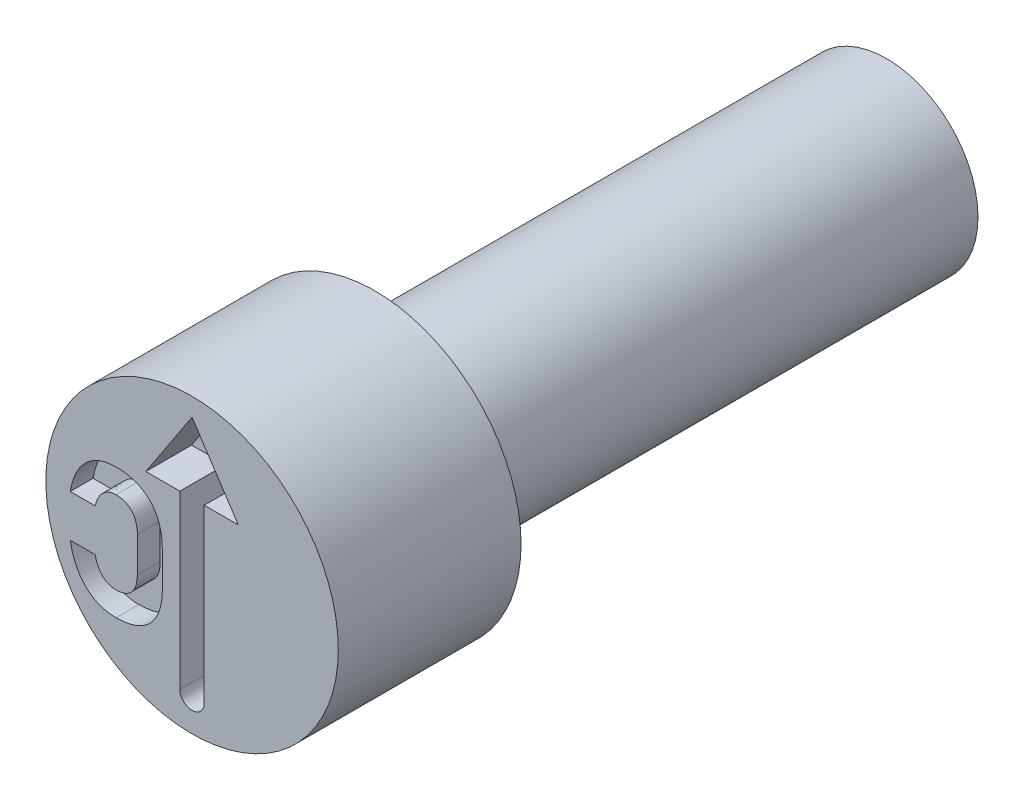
ISO-10303-21;
HEADER;
FILE_DESCRIPTION(('STEP AP214'),'2;1');
FILE_NAME('part.step','',(''),(''),'','','');
FILE_SCHEMA(('AUTOMOTIVE_DESIGN { 1 0 10303 214 1 1 1 1 }'));
ENDSEC;
DATA;
#1=APPLICATION_CONTEXT('core data for automotive mechanical design processes');
#2=APPLICATION_PROTOCOL_DEFINITION('international standard','automotive_design',2000,#1);
#3=PRODUCT_CONTEXT('',#1,'mechanical');
#4=PRODUCT('Part','Part','',(#3));
#5=PRODUCT_RELATED_PRODUCT_CATEGORY('part','',(#4));
#6=PRODUCT_DEFINITION_FORMATION('','',#4);
#7=PRODUCT_DEFINITION_CONTEXT('part definition',#1,'design');
#8=PRODUCT_DEFINITION('design','',#6,#7);
#9=PRODUCT_DEFINITION_SHAPE('','',#8);
#10=(LENGTH_UNIT() NAMED_UNIT(*) SI_UNIT(.MILLI.,.METRE.));
#11=(NAMED_UNIT(*) PLANE_ANGLE_UNIT() SI_UNIT($,.RADIAN.));
#12=(NAMED_UNIT(*) SI_UNIT($,.STERADIAN.) SOLID_ANGLE_UNIT());
#13=UNCERTAINTY_MEASURE_WITH_UNIT(LENGTH_MEASURE(1.E-05),#10,'distance_accuracy_value','');
#14=(GEOMETRIC_REPRESENTATION_CONTEXT(3) GLOBAL_UNCERTAINTY_ASSIGNED_CONTEXT((#13)) GLOBAL_UNIT_ASSIGNED_CONTEXT((#10,
#11,#12)) REPRESENTATION_CONTEXT('',''));
#15=CARTESIAN_POINT('',(0.,0.,0.));
#16=DIRECTION('',(0.,0.,1.));
#17=DIRECTION('',(1.,0.,0.));
#18=AXIS2_PLACEMENT_3D('',#15,#16,#17);
#19=CARTESIAN_POINT('',(0.,0.5,-1.));
#20=DIRECTION('',(0.,0.,1.));
#21=DIRECTION('',(1.,0.,0.));
#22=AXIS2_PLACEMENT_3D('',#19,#20,#21);
#23=PLANE('',#22);
#24=CARTESIAN_POINT('',(0.,0.,-1.));
#25=DIRECTION('',(0.,0.,1.));
#26=DIRECTION('',(1.,0.,0.));
#27=AXIS2_PLACEMENT_3D('',#24,#25,#26);
#28=CIRCLE('',#27,0.8);
#29=CARTESIAN_POINT('',(0.8,0.,-1.));
#30=VERTEX_POINT('',#29);
#31=EDGE_CURVE('E11',#30,#30,#28,.T.);
#32=ORIENTED_EDGE('',*,*,#31,.F.);
#33=EDGE_LOOP('',(#32));
#34=FACE_BOUND('',#33,.T.);
#35=CARTESIAN_POINT('',(0.,0.,-1.));
#36=DIRECTION('',(0.,0.,1.));
#37=DIRECTION('',(1.,0.,0.));
#38=AXIS2_PLACEMENT_3D('',#35,#36,#37);
#39=CIRCLE('',#38,0.5);
#40=CARTESIAN_POINT('',(0.5,0.,-1.));
#41=VERTEX_POINT('',#40);
#42=EDGE_CURVE('E262',#41,#41,#39,.T.);
#43=ORIENTED_EDGE('',*,*,#42,.T.);
#44=EDGE_LOOP('',(#43));
#45=FACE_BOUND('',#44,.T.);
#46=ADVANCED_FACE('F34',(#34,#45),#23,.F.);
#47=CARTESIAN_POINT('',(0.,0.,-0.403888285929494));
#48=DIRECTION('',(0.,0.,1.));
#49=DIRECTION('',(1.,0.,0.));
#50=AXIS2_PLACEMENT_3D('',#47,#48,#49);
#51=CYLINDRICAL_SURFACE('',#50,0.8);
#52=CARTESIAN_POINT('',(0.,0.,0.));
#53=DIRECTION('',(0.,0.,1.));
#54=DIRECTION('',(1.,0.,0.));
#55=AXIS2_PLACEMENT_3D('',#52,#53,#54);
#56=CIRCLE('',#55,0.8);
#57=CARTESIAN_POINT('',(0.8,0.,0.));
#58=VERTEX_POINT('',#57);
#59=EDGE_CURVE('E41',#58,#58,#56,.T.);
#60=ORIENTED_EDGE('',*,*,#59,.F.);
#61=EDGE_LOOP('',(#60));
#62=FACE_BOUND('',#61,.T.);
#63=ORIENTED_EDGE('',*,*,#31,.T.);
#64=EDGE_LOOP('',(#63));
#65=FACE_BOUND('',#64,.T.);
#66=ADVANCED_FACE('F247',(#62,#65),#51,.T.);
#67=CARTESIAN_POINT('',(0.,0.8,0.));
#68=DIRECTION('',(0.,0.,-1.));
#69=DIRECTION('',(-1.,0.,0.));
#70=AXIS2_PLACEMENT_3D('',#67,#68,#69);
#71=PLANE('',#70);
#72=CARTESIAN_POINT('',(-0.41583452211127,-0.457275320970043,0.));
#73=CARTESIAN_POINT('',(-0.409317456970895,-0.45720482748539,0.));
#74=CARTESIAN_POINT('',(-0.396457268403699,-0.457065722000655,0.));
#75=CARTESIAN_POINT('',(-0.377547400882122,-0.455618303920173,0.));
#76=CARTESIAN_POINT('',(-0.3593040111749,-0.453198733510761,0.));
#77=CARTESIAN_POINT('',(-0.34182658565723,-0.449786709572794,0.));
#78=CARTESIAN_POINT('',(-0.3250668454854,-0.445482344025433,0.));
#79=CARTESIAN_POINT('',(-0.308953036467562,-0.440394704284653,0.));
#80=CARTESIAN_POINT('',(-0.293640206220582,-0.434096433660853,0.));
#81=CARTESIAN_POINT('',(-0.278979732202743,-0.426954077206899,0.));
#82=CARTESIAN_POINT('',(-0.265178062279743,-0.418870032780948,0.));
#83=CARTESIAN_POINT('',(-0.252264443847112,-0.409777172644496,0.));
#84=CARTESIAN_POINT('',(-0.240110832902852,-0.399960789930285,0.));
#85=CARTESIAN_POINT('',(-0.228809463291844,-0.389224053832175,0.));
#86=CARTESIAN_POINT('',(-0.218372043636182,-0.377629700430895,0.));
#87=CARTESIAN_POINT('',(-0.208739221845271,-0.365164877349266,0.));
#88=CARTESIAN_POINT('',(-0.200108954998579,-0.351750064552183,0.));
#89=CARTESIAN_POINT('',(-0.192213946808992,-0.337566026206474,0.));
#90=CARTESIAN_POINT('',(-0.185189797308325,-0.322573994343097,0.));
#91=CARTESIAN_POINT('',(-0.179261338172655,-0.306702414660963,0.));
#92=CARTESIAN_POINT('',(-0.174121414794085,-0.290126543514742,0.));
#93=CARTESIAN_POINT('',(-0.169821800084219,-0.272849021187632,0.));
#94=CARTESIAN_POINT('',(-0.166529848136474,-0.254791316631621,0.));
#95=CARTESIAN_POINT('',(-0.164335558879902,-0.235967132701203,0.));
#96=CARTESIAN_POINT('',(-0.162814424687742,-0.216358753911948,0.));
#97=CARTESIAN_POINT('',(-0.162688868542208,-0.203022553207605,0.));
#98=CARTESIAN_POINT('',(-0.162624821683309,-0.196219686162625,0.));
#99=B_SPLINE_CURVE_WITH_KNOTS('',3,(#72,#73,#74,#75,#76,#77,#78,#79,#80,#81,#82,#83,#84,#85,#86,
#87,#88,#89,#90,#91,#92,#93,#94,#95,#96,#97,#98),.UNSPECIFIED.,.F.,.F.,(4,1,1,1,1,1,1,1,1,1,1,1,
1,1,1,1,1,1,1,1,1,1,1,1,4),(0.,0.0472598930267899,0.093258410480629,0.137448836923,
0.180669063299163,0.222325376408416,0.262898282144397,0.303117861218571,0.342294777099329,
0.381096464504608,0.418984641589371,0.456742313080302,0.494310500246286,0.531916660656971,
0.569787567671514,0.608434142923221,0.647492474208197,0.687453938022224,0.728384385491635,
0.770272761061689,0.813266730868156,0.85743965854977,0.903297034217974,0.950671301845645,1.),.UNSPECIFIED.);
#100=CARTESIAN_POINT('',(-0.41583452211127,-0.457275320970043,0.));
#101=VERTEX_POINT('',#100);
#102=CARTESIAN_POINT('',(-0.162624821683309,-0.196219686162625,0.));
#103=VERTEX_POINT('',#102);
#104=EDGE_CURVE('E400',#101,#103,#99,.T.);
#105=ORIENTED_EDGE('',*,*,#104,.F.);
#106=CARTESIAN_POINT('',(-0.666619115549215,-0.215477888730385,0.));
#107=CARTESIAN_POINT('',(-0.664181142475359,-0.227847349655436,0.));
#108=CARTESIAN_POINT('',(-0.659441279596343,-0.251895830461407,0.));
#109=CARTESIAN_POINT('',(-0.648789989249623,-0.28614256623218,0.));
#110=CARTESIAN_POINT('',(-0.63566411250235,-0.317607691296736,0.));
#111=CARTESIAN_POINT('',(-0.620043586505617,-0.346244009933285,0.));
#112=CARTESIAN_POINT('',(-0.601833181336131,-0.3717683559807,0.));
#113=CARTESIAN_POINT('',(-0.581468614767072,-0.394276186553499,0.));
#114=CARTESIAN_POINT('',(-0.558777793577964,-0.413577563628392,0.));
#115=CARTESIAN_POINT('',(-0.533807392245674,-0.42947853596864,0.));
#116=CARTESIAN_POINT('',(-0.506845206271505,-0.441979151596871,0.));
#117=CARTESIAN_POINT('',(-0.478038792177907,-0.450758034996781,0.));
#118=CARTESIAN_POINT('',(-0.447536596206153,-0.456437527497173,0.));
#119=CARTESIAN_POINT('',(-0.426559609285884,-0.456991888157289,0.));
#120=CARTESIAN_POINT('',(-0.41583452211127,-0.457275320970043,0.));
#121=B_SPLINE_CURVE_WITH_KNOTS('',3,(#106,#107,#108,#109,#110,#111,#112,#113,#114,#115,#116,
#117,#118,#119,#120),.UNSPECIFIED.,.F.,.F.,(4,1,1,1,1,1,1,1,1,1,1,1,4),(0.,0.0988237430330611,
0.192131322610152,0.28071953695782,0.365844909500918,0.447392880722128,0.52606487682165,
0.603327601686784,0.680299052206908,0.757555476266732,0.835645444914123,0.915969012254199,1.),.UNSPECIFIED.);
#122=CARTESIAN_POINT('',(-0.666619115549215,-0.215477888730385,0.));
#123=VERTEX_POINT('',#122);
#124=EDGE_CURVE('E48',#123,#101,#121,.T.);
#125=ORIENTED_EDGE('',*,*,#124,.F.);
#126=DIRECTION('',(-1.,0.,0.));
#127=VECTOR('',#126,1.);
#128=CARTESIAN_POINT('',(-0.529957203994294,-0.215477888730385,0.));
#129=LINE('',#128,#127);
#130=CARTESIAN_POINT('',(-0.529957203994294,-0.215477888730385,0.));
#131=VERTEX_POINT('',#130);
#132=EDGE_CURVE('E185',#131,#123,#129,.T.);
#133=ORIENTED_EDGE('',*,*,#132,.F.);
#134=CARTESIAN_POINT('',(-0.41583452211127,-0.325320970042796,0.));
#135=CARTESIAN_POINT('',(-0.420549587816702,-0.325135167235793,0.));
#136=CARTESIAN_POINT('',(-0.429797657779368,-0.324770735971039,0.));
#137=CARTESIAN_POINT('',(-0.443308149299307,-0.32253976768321,0.));
#138=CARTESIAN_POINT('',(-0.456028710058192,-0.318428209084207,0.));
#139=CARTESIAN_POINT('',(-0.468045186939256,-0.312888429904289,0.));
#140=CARTESIAN_POINT('',(-0.479269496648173,-0.305731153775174,0.));
#141=CARTESIAN_POINT('',(-0.489381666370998,-0.296887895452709,0.));
#142=CARTESIAN_POINT('',(-0.498800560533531,-0.286821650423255,0.));
#143=CARTESIAN_POINT('',(-0.507183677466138,-0.275204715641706,0.));
#144=CARTESIAN_POINT('',(-0.51461498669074,-0.262204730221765,0.));
#145=CARTESIAN_POINT('',(-0.520829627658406,-0.247816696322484,0.));
#146=CARTESIAN_POINT('',(-0.526224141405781,-0.23220085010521,0.));
#147=CARTESIAN_POINT('',(-0.528687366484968,-0.221166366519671,0.));
#148=CARTESIAN_POINT('',(-0.529957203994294,-0.215477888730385,0.));
#149=B_SPLINE_CURVE_WITH_KNOTS('',3,(#134,#135,#136,#137,#138,#139,#140,#141,#142,#143,#144,
#145,#146,#147,#148),.UNSPECIFIED.,.F.,.F.,(4,1,1,1,1,1,1,1,1,1,1,1,4),(0.,0.081756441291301,
0.160356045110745,0.236478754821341,0.312819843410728,0.389192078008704,0.466352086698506,
0.545094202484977,0.627698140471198,0.714093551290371,0.80415108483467,0.89903630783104,1.),.UNSPECIFIED.);
#150=CARTESIAN_POINT('',(-0.41583452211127,-0.325320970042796,0.));
#151=VERTEX_POINT('',#150);
#152=EDGE_CURVE('E188',#151,#131,#149,.T.);
#153=ORIENTED_EDGE('',*,*,#152,.F.);
#154=CARTESIAN_POINT('',(-0.299286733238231,-0.196219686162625,0.));
#155=CARTESIAN_POINT('',(-0.29944050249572,-0.20279036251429,0.));
#156=CARTESIAN_POINT('',(-0.299738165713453,-0.21550973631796,0.));
#157=CARTESIAN_POINT('',(-0.30231695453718,-0.233833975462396,0.));
#158=CARTESIAN_POINT('',(-0.306583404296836,-0.250689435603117,0.));
#159=CARTESIAN_POINT('',(-0.312502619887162,-0.266047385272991,0.));
#160=CARTESIAN_POINT('',(-0.320277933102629,-0.279688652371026,0.));
#161=CARTESIAN_POINT('',(-0.32951168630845,-0.291723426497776,0.));
#162=CARTESIAN_POINT('',(-0.340257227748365,-0.302122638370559,0.));
#163=CARTESIAN_POINT('',(-0.352681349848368,-0.310583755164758,0.));
#164=CARTESIAN_POINT('',(-0.36654107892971,-0.317202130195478,0.));
#165=CARTESIAN_POINT('',(-0.381783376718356,-0.321854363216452,0.));
#166=CARTESIAN_POINT('',(-0.398367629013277,-0.32477467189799,0.));
#167=CARTESIAN_POINT('',(-0.409877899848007,-0.325134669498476,0.));
#168=CARTESIAN_POINT('',(-0.41583452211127,-0.325320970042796,0.));
#169=B_SPLINE_CURVE_WITH_KNOTS('',3,(#154,#155,#156,#157,#158,#159,#160,#161,#162,#163,#164,
#165,#166,#167,#168),.UNSPECIFIED.,.F.,.F.,(4,1,1,1,1,1,1,1,1,1,1,1,4),(0.,0.0997433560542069,
0.193081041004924,0.280299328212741,0.363302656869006,0.442209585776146,0.517891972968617,
0.592965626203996,0.668275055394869,0.745143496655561,0.825309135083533,0.909596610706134,1.),.UNSPECIFIED.);
#170=CARTESIAN_POINT('',(-0.299286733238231,-0.196219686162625,0.));
#171=VERTEX_POINT('',#170);
#172=EDGE_CURVE('E348',#171,#151,#169,.T.);
#173=ORIENTED_EDGE('',*,*,#172,.F.);
#174=DIRECTION('',(0.,-1.,0.));
#175=VECTOR('',#174,1.);
#176=CARTESIAN_POINT('',(-0.299286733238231,-0.00420827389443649,0.));
#177=LINE('',#176,#175);
#178=CARTESIAN_POINT('',(-0.299286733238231,-0.00420827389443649,0.));
#179=VERTEX_POINT('',#178);
#180=EDGE_CURVE('E356',#179,#171,#177,.T.);
#181=ORIENTED_EDGE('',*,*,#180,.F.);
#182=CARTESIAN_POINT('',(-0.41583452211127,0.125320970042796,0.));
#183=CARTESIAN_POINT('',(-0.409882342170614,0.125112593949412,0.));
#184=CARTESIAN_POINT('',(-0.398388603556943,0.124710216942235,0.));
#185=CARTESIAN_POINT('',(-0.381737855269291,0.122088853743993,0.));
#186=CARTESIAN_POINT('',(-0.366570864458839,0.117150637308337,0.));
#187=CARTESIAN_POINT('',(-0.352675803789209,0.11059959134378,0.));
#188=CARTESIAN_POINT('',(-0.340263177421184,0.102114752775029,0.));
#189=CARTESIAN_POINT('',(-0.329466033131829,0.0917130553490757,0.));
#190=CARTESIAN_POINT('',(-0.320278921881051,0.0795356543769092,0.));
#191=CARTESIAN_POINT('',(-0.31253747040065,0.0657921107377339,0.));
#192=CARTESIAN_POINT('',(-0.306551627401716,0.0503658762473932,0.));
#193=CARTESIAN_POINT('',(-0.30233990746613,0.033447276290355,0.));
#194=CARTESIAN_POINT('',(-0.299733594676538,0.0150830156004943,0.));
#195=CARTESIAN_POINT('',(-0.299438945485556,0.0023628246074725,0.));
#196=CARTESIAN_POINT('',(-0.299286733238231,-0.00420827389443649,0.));
#197=B_SPLINE_CURVE_WITH_KNOTS('',3,(#182,#183,#184,#185,#186,#187,#188,#189,#190,#191,#192,
#193,#194,#195,#196),.UNSPECIFIED.,.F.,.F.,(4,1,1,1,1,1,1,1,1,1,1,1,4),(0.,0.0902231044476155,
0.174222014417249,0.25444494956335,0.331160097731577,0.406319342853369,0.481243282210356,
0.557346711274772,0.636723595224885,0.719561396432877,0.807304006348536,0.900455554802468,1.),.UNSPECIFIED.);
#198=CARTESIAN_POINT('',(-0.41583452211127,0.125320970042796,0.));
#199=VERTEX_POINT('',#198);
#200=EDGE_CURVE('E362',#199,#179,#197,.T.);
#201=ORIENTED_EDGE('',*,*,#200,.F.);
#202=CARTESIAN_POINT('',(-0.529957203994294,0.0156205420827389,0.));
#203=CARTESIAN_POINT('',(-0.52857871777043,0.0212121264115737,0.));
#204=CARTESIAN_POINT('',(-0.525896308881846,0.032092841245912,0.));
#205=CARTESIAN_POINT('',(-0.520373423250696,0.0475715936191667,0.));
#206=CARTESIAN_POINT('',(-0.51409335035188,0.0619090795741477,0.));
#207=CARTESIAN_POINT('',(-0.506412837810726,0.0747637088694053,0.));
#208=CARTESIAN_POINT('',(-0.498051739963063,0.0864458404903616,0.));
#209=CARTESIAN_POINT('',(-0.48862235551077,0.0965668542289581,0.));
#210=CARTESIAN_POINT('',(-0.478331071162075,0.105294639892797,0.));
#211=CARTESIAN_POINT('',(-0.467257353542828,0.112513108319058,0.));
#212=CARTESIAN_POINT('',(-0.455431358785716,0.118396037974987,0.));
#213=CARTESIAN_POINT('',(-0.442799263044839,0.122289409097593,0.));
#214=CARTESIAN_POINT('',(-0.429535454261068,0.124831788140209,0.));
#215=CARTESIAN_POINT('',(-0.420459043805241,0.125155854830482,0.));
#216=CARTESIAN_POINT('',(-0.41583452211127,0.125320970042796,0.));
#217=B_SPLINE_CURVE_WITH_KNOTS('',3,(#202,#203,#204,#205,#206,#207,#208,#209,#210,#211,#212,
#213,#214,#215,#216),.UNSPECIFIED.,.F.,.F.,(4,1,1,1,1,1,1,1,1,1,1,1,4),(0.,0.100258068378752,
0.195093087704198,0.285925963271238,0.37244127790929,0.455447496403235,0.535743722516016,
0.612742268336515,0.689936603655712,0.765509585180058,0.842003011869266,0.919498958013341,1.),.UNSPECIFIED.);
#218=CARTESIAN_POINT('',(-0.529957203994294,0.0156205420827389,0.));
#219=VERTEX_POINT('',#218);
#220=EDGE_CURVE('E367',#219,#199,#217,.T.);
#221=ORIENTED_EDGE('',*,*,#220,.F.);
#222=DIRECTION('',(1.,0.,0.));
#223=VECTOR('',#222,1.);
#224=CARTESIAN_POINT('',(-0.666619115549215,0.0156205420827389,0.));
#225=LINE('',#224,#223);
#226=CARTESIAN_POINT('',(-0.666619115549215,0.0156205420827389,0.));
#227=VERTEX_POINT('',#226);
#228=EDGE_CURVE('E375',#227,#219,#225,.T.);
#229=ORIENTED_EDGE('',*,*,#228,.F.);
#230=CARTESIAN_POINT('',(-0.41583452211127,0.257275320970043,0.));
#231=CARTESIAN_POINT('',(-0.426559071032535,0.256988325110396,0.));
#232=CARTESIAN_POINT('',(-0.447581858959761,0.256425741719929,0.));
#233=CARTESIAN_POINT('',(-0.478136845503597,0.250777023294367,0.));
#234=CARTESIAN_POINT('',(-0.506990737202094,0.241982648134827,0.));
#235=CARTESIAN_POINT('',(-0.533974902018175,0.22944262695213,0.));
#236=CARTESIAN_POINT('',(-0.559004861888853,0.213620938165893,0.));
#237=CARTESIAN_POINT('',(-0.581787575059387,0.194370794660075,0.));
#238=CARTESIAN_POINT('',(-0.602315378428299,0.171944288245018,0.));
#239=CARTESIAN_POINT('',(-0.620411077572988,0.146249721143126,0.));
#240=CARTESIAN_POINT('',(-0.636126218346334,0.117645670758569,0.));
#241=CARTESIAN_POINT('',(-0.64906352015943,0.0861286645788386,0.));
#242=CARTESIAN_POINT('',(-0.659564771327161,0.0519336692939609,0.));
#243=CARTESIAN_POINT('',(-0.664225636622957,0.0279412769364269,0.));
#244=CARTESIAN_POINT('',(-0.666619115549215,0.0156205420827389,0.));
#245=B_SPLINE_CURVE_WITH_KNOTS('',3,(#230,#231,#232,#233,#234,#235,#236,#237,#238,#239,#240,
#241,#242,#243,#244),.UNSPECIFIED.,.F.,.F.,(4,1,1,1,1,1,1,1,1,1,1,1,4),(0.,0.0840057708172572,
0.164672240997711,0.242738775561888,0.319972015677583,0.397234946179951,0.474233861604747,
0.553133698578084,0.634960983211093,0.720060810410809,0.808478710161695,0.901648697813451,1.),.UNSPECIFIED.);
#246=CARTESIAN_POINT('',(-0.41583452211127,0.257275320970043,0.));
#247=VERTEX_POINT('',#246);
#248=EDGE_CURVE('E381',#247,#227,#245,.T.);
#249=ORIENTED_EDGE('',*,*,#248,.F.);
#250=CARTESIAN_POINT('',(-0.162624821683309,-0.00420827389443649,0.));
#251=CARTESIAN_POINT('',(-0.162688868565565,0.00259459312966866,0.));
#252=CARTESIAN_POINT('',(-0.162814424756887,0.0159307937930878,0.));
#253=CARTESIAN_POINT('',(-0.164335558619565,0.035539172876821,0.));
#254=CARTESIAN_POINT('',(-0.166529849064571,0.0543633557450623,0.));
#255=CARTESIAN_POINT('',(-0.16982179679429,0.0724210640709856,0.));
#256=CARTESIAN_POINT('',(-0.17412142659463,0.0896985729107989,0.));
#257=CARTESIAN_POINT('',(-0.179261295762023,0.106274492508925,0.));
#258=CARTESIAN_POINT('',(-0.185189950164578,0.122145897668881,0.));
#259=CARTESIAN_POINT('',(-0.192213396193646,0.137138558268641,0.));
#260=CARTESIAN_POINT('',(-0.200110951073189,0.151320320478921,0.));
#261=CARTESIAN_POINT('',(-0.208731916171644,0.164743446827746,0.));
#262=CARTESIAN_POINT('',(-0.218420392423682,0.177205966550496,0.));
#263=CARTESIAN_POINT('',(-0.22875868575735,0.188936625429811,0.));
#264=CARTESIAN_POINT('',(-0.240117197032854,0.199670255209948,0.));
#265=CARTESIAN_POINT('',(-0.252264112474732,0.209490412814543,0.));
#266=CARTESIAN_POINT('',(-0.265172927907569,0.218595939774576,0.));
#267=CARTESIAN_POINT('',(-0.27901954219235,0.226634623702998,0.));
#268=CARTESIAN_POINT('',(-0.29359558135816,0.234000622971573,0.));
#269=CARTESIAN_POINT('',(-0.308987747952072,0.240199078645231,0.));
#270=CARTESIAN_POINT('',(-0.325035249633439,0.245530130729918,0.));
#271=CARTESIAN_POINT('',(-0.341831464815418,0.249772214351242,0.));
#272=CARTESIAN_POINT('',(-0.359302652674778,0.253202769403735,0.));
#273=CARTESIAN_POINT('',(-0.377547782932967,0.255617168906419,0.));
#274=CARTESIAN_POINT('',(-0.396457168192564,0.257066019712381,0.));
#275=CARTESIAN_POINT('',(-0.409317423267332,0.257204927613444,0.));
#276=CARTESIAN_POINT('',(-0.41583452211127,0.257275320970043,0.));
#277=B_SPLINE_CURVE_WITH_KNOTS('',3,(#250,#251,#252,#253,#254,#255,#256,#257,#258,#259,#260,
#261,#262,#263,#264,#265,#266,#267,#268,#269,#270,#271,#272,#273,#274,#275,#276),.UNSPECIFIED.,
.F.,.F.,(4,1,1,1,1,1,1,1,1,1,1,1,1,1,1,1,1,1,1,1,1,1,1,1,4),(0.,0.0493032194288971,
0.0966530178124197,0.142486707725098,0.186636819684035,0.229608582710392,0.271475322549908,
0.31238462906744,0.352325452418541,0.391363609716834,0.429990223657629,0.467841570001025,
0.505685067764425,0.543233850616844,0.580972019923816,0.618840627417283,0.657622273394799,
0.696931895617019,0.737130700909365,0.777789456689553,0.819424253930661,0.862622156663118,
0.906789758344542,0.952764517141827,1.),.UNSPECIFIED.);
#278=CARTESIAN_POINT('',(-0.162624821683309,-0.00420827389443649,0.));
#279=VERTEX_POINT('',#278);
#280=EDGE_CURVE('E386',#279,#247,#277,.T.);
#281=ORIENTED_EDGE('',*,*,#280,.F.);
#282=DIRECTION('',(0.,1.,0.));
#283=VECTOR('',#282,1.);
#284=CARTESIAN_POINT('',(-0.162624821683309,-0.196219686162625,0.));
#285=LINE('',#284,#283);
#286=EDGE_CURVE('E394',#103,#279,#285,.T.);
#287=ORIENTED_EDGE('',*,*,#286,.F.);
#288=EDGE_LOOP('',(#105,#125,#133,#153,#173,#181,#201,#221,#229,#249,#281,#287));
#289=FACE_BOUND('',#288,.T.);
#290=DIRECTION('',(0.,1.,0.));
#291=VECTOR('',#290,1.);
#292=CARTESIAN_POINT('',(0.0666655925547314,0.31722300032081,0.));
#293=LINE('',#292,#291);
#294=CARTESIAN_POINT('',(0.0666655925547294,-0.62165664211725,0.));
#295=VERTEX_POINT('',#294);
#296=CARTESIAN_POINT('',(0.0666655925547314,0.31722300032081,0.));
#297=VERTEX_POINT('',#296);
#298=EDGE_CURVE('E300',#295,#297,#293,.T.);
#299=ORIENTED_EDGE('',*,*,#298,.F.);
#300=CARTESIAN_POINT('',(0.,-0.62165664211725,0.));
#301=DIRECTION('',(0.,0.,1.));
#302=DIRECTION('',(1.,0.,0.));
#303=AXIS2_PLACEMENT_3D('',#300,#301,#302);
#304=CIRCLE('',#303,0.0666655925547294);
#305=CARTESIAN_POINT('',(-0.0666655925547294,-0.62165664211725,0.));
#306=VERTEX_POINT('',#305);
#307=EDGE_CURVE('E56',#306,#295,#304,.T.);
#308=ORIENTED_EDGE('',*,*,#307,.F.);
#309=DIRECTION('',(0.,-1.,0.));
#310=VECTOR('',#309,1.);
#311=CARTESIAN_POINT('',(-0.0666655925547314,0.31722300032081,0.));
#312=LINE('',#311,#310);
#313=CARTESIAN_POINT('',(-0.0666655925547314,0.31722300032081,0.));
#314=VERTEX_POINT('',#313);
#315=EDGE_CURVE('E284',#314,#306,#312,.T.);
#316=ORIENTED_EDGE('',*,*,#315,.F.);
#317=DIRECTION('',(1.,0.,0.));
#318=VECTOR('',#317,1.);
#319=CARTESIAN_POINT('',(-0.252671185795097,0.31722300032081,0.));
#320=LINE('',#319,#318);
#321=CARTESIAN_POINT('',(-0.252671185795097,0.31722300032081,0.));
#322=VERTEX_POINT('',#321);
#323=EDGE_CURVE('E288',#322,#314,#320,.T.);
#324=ORIENTED_EDGE('',*,*,#323,.F.);
#325=DIRECTION('',(-0.550159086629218,-0.835059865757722,0.));
#326=VECTOR('',#325,1.);
#327=CARTESIAN_POINT('',(0.,0.700740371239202,0.));
#328=LINE('',#327,#326);
#329=CARTESIAN_POINT('',(0.,0.700740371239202,0.));
#330=VERTEX_POINT('',#329);
#331=EDGE_CURVE('E291',#330,#322,#328,.T.);
#332=ORIENTED_EDGE('',*,*,#331,.F.);
#333=DIRECTION('',(-0.550159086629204,0.835059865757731,0.));
#334=VECTOR('',#333,1.);
#335=CARTESIAN_POINT('',(0.,0.700740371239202,0.));
#336=LINE('',#335,#334);
#337=CARTESIAN_POINT('',(0.252671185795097,0.31722300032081,0.));
#338=VERTEX_POINT('',#337);
#339=EDGE_CURVE('E294',#338,#330,#336,.T.);
#340=ORIENTED_EDGE('',*,*,#339,.F.);
#341=DIRECTION('',(1.,0.,0.));
#342=VECTOR('',#341,1.);
#343=CARTESIAN_POINT('',(0.252671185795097,0.31722300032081,0.));
#344=LINE('',#343,#342);
#345=EDGE_CURVE('E297',#297,#338,#344,.T.);
#346=ORIENTED_EDGE('',*,*,#345,.F.);
#347=EDGE_LOOP('',(#299,#308,#316,#324,#332,#340,#346));
#348=FACE_BOUND('',#347,.T.);
#349=ORIENTED_EDGE('',*,*,#59,.T.);
#350=EDGE_LOOP('',(#349));
#351=FACE_BOUND('',#350,.T.);
#352=ADVANCED_FACE('F244',(#289,#348,#351),#71,.F.);
#353=CARTESIAN_POINT('',(0.,0.,-3.8));
#354=DIRECTION('',(0.,0.,1.));
#355=DIRECTION('',(1.,0.,0.));
#356=AXIS2_PLACEMENT_3D('',#353,#354,#355);
#357=PLANE('',#356);
#358=CARTESIAN_POINT('',(0.,0.,-3.8));
#359=DIRECTION('',(0.,0.,1.));
#360=DIRECTION('',(1.,0.,0.));
#361=AXIS2_PLACEMENT_3D('',#358,#359,#360);
#362=CIRCLE('',#361,0.5);
#363=CARTESIAN_POINT('',(0.5,0.,-3.8));
#364=VERTEX_POINT('',#363);
#365=EDGE_CURVE('E263',#364,#364,#362,.T.);
#366=ORIENTED_EDGE('',*,*,#365,.F.);
#367=EDGE_LOOP('',(#366));
#368=FACE_BOUND('',#367,.T.);
#369=ADVANCED_FACE('F240',(#368),#357,.F.);
#370=CARTESIAN_POINT('',(0.,0.,-0.403888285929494));
#371=DIRECTION('',(0.,0.,1.));
#372=DIRECTION('',(1.,0.,0.));
#373=AXIS2_PLACEMENT_3D('',#370,#371,#372);
#374=CYLINDRICAL_SURFACE('',#373,0.5);
#375=ORIENTED_EDGE('',*,*,#42,.F.);
#376=EDGE_LOOP('',(#375));
#377=FACE_BOUND('',#376,.T.);
#378=ORIENTED_EDGE('',*,*,#365,.T.);
#379=EDGE_LOOP('',(#378));
#380=FACE_BOUND('',#379,.T.);
#381=ADVANCED_FACE('F237',(#377,#380),#374,.T.);
#382=CARTESIAN_POINT('',(0.,-0.62165664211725,-0.25));
#383=DIRECTION('',(0.,0.,1.));
#384=DIRECTION('',(1.,0.,0.));
#385=AXIS2_PLACEMENT_3D('',#382,#383,#384);
#386=CYLINDRICAL_SURFACE('',#385,0.0666655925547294);
#387=ORIENTED_EDGE('',*,*,#307,.T.);
#388=DIRECTION('',(0.,0.,1.));
#389=VECTOR('',#388,1.);
#390=CARTESIAN_POINT('',(0.0666655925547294,-0.62165664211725,-0.25));
#391=LINE('',#390,#389);
#392=CARTESIAN_POINT('',(0.0666655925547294,-0.62165664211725,-0.25));
#393=VERTEX_POINT('',#392);
#394=EDGE_CURVE('E271',#393,#295,#391,.T.);
#395=ORIENTED_EDGE('',*,*,#394,.F.);
#396=CARTESIAN_POINT('',(0.,-0.62165664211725,-0.25));
#397=DIRECTION('',(0.,0.,1.));
#398=DIRECTION('',(1.,0.,0.));
#399=AXIS2_PLACEMENT_3D('',#396,#397,#398);
#400=CIRCLE('',#399,0.0666655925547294);
#401=CARTESIAN_POINT('',(-0.0666655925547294,-0.62165664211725,-0.25));
#402=VERTEX_POINT('',#401);
#403=EDGE_CURVE('E287',#402,#393,#400,.T.);
#404=ORIENTED_EDGE('',*,*,#403,.F.);
#405=DIRECTION('',(0.,0.,1.));
#406=VECTOR('',#405,1.);
#407=CARTESIAN_POINT('',(-0.0666655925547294,-0.62165664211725,-0.25));
#408=LINE('',#407,#406);
#409=EDGE_CURVE('E264',#402,#306,#408,.T.);
#410=ORIENTED_EDGE('',*,*,#409,.T.);
#411=EDGE_LOOP('',(#387,#395,#404,#410));
#412=FACE_BOUND('',#411,.T.);
#413=ADVANCED_FACE('F215',(#412),#386,.F.);
#414=CARTESIAN_POINT('',(-0.0666655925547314,0.31722300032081,-0.25));
#415=DIRECTION('',(-1.,0.,0.));
#416=DIRECTION('',(0.,-1.,0.));
#417=AXIS2_PLACEMENT_3D('',#414,#415,#416);
#418=PLANE('',#417);
#419=ORIENTED_EDGE('',*,*,#315,.T.);
#420=ORIENTED_EDGE('',*,*,#409,.F.);
#421=DIRECTION('',(0.,-1.,0.));
#422=VECTOR('',#421,1.);
#423=CARTESIAN_POINT('',(-0.0666655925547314,0.31722300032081,-0.25));
#424=LINE('',#423,#422);
#425=CARTESIAN_POINT('',(-0.0666655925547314,0.31722300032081,-0.25));
#426=VERTEX_POINT('',#425);
#427=EDGE_CURVE('E275',#426,#402,#424,.T.);
#428=ORIENTED_EDGE('',*,*,#427,.F.);
#429=DIRECTION('',(0.,0.,1.));
#430=VECTOR('',#429,1.);
#431=CARTESIAN_POINT('',(-0.0666655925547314,0.31722300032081,-0.25));
#432=LINE('',#431,#430);
#433=EDGE_CURVE('E268',#426,#314,#432,.T.);
#434=ORIENTED_EDGE('',*,*,#433,.T.);
#435=EDGE_LOOP('',(#419,#420,#428,#434));
#436=FACE_BOUND('',#435,.T.);
#437=ADVANCED_FACE('F211',(#436),#418,.F.);
#438=CARTESIAN_POINT('',(-0.252671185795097,0.31722300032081,-0.25));
#439=DIRECTION('',(0.,-1.,0.));
#440=DIRECTION('',(0.,0.,-1.));
#441=AXIS2_PLACEMENT_3D('',#438,#439,#440);
#442=PLANE('',#441);
#443=ORIENTED_EDGE('',*,*,#323,.T.);
#444=ORIENTED_EDGE('',*,*,#433,.F.);
#445=DIRECTION('',(1.,0.,0.));
#446=VECTOR('',#445,1.);
#447=CARTESIAN_POINT('',(-0.252671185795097,0.31722300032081,-0.25));
#448=LINE('',#447,#446);
#449=CARTESIAN_POINT('',(-0.252671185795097,0.31722300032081,-0.25));
#450=VERTEX_POINT('',#449);
#451=EDGE_CURVE('E307',#450,#426,#448,.T.);
#452=ORIENTED_EDGE('',*,*,#451,.F.);
#453=DIRECTION('',(0.,0.,1.));
#454=VECTOR('',#453,1.);
#455=CARTESIAN_POINT('',(-0.252671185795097,0.31722300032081,-0.25));
#456=LINE('',#455,#454);
#457=EDGE_CURVE('E281',#450,#322,#456,.T.);
#458=ORIENTED_EDGE('',*,*,#457,.T.);
#459=EDGE_LOOP('',(#443,#444,#452,#458));
#460=FACE_BOUND('',#459,.T.);
#461=ADVANCED_FACE('F214',(#460),#442,.F.);
#462=CARTESIAN_POINT('',(0.,0.700740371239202,-0.25));
#463=DIRECTION('',(-0.835059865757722,0.550159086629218,0.));
#464=DIRECTION('',(-0.550159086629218,-0.835059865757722,0.));
#465=AXIS2_PLACEMENT_3D('',#462,#463,#464);
#466=PLANE('',#465);
#467=ORIENTED_EDGE('',*,*,#331,.T.);
#468=ORIENTED_EDGE('',*,*,#457,.F.);
#469=DIRECTION('',(-0.550159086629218,-0.835059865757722,0.));
#470=VECTOR('',#469,1.);
#471=CARTESIAN_POINT('',(0.,0.700740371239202,-0.25));
#472=LINE('',#471,#470);
#473=CARTESIAN_POINT('',(0.,0.700740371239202,-0.25));
#474=VERTEX_POINT('',#473);
#475=EDGE_CURVE('E310',#474,#450,#472,.T.);
#476=ORIENTED_EDGE('',*,*,#475,.F.);
#477=DIRECTION('',(0.,0.,1.));
#478=VECTOR('',#477,1.);
#479=CARTESIAN_POINT('',(0.,0.700740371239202,-0.25));
#480=LINE('',#479,#478);
#481=EDGE_CURVE('E279',#474,#330,#480,.T.);
#482=ORIENTED_EDGE('',*,*,#481,.T.);
#483=EDGE_LOOP('',(#467,#468,#476,#482));
#484=FACE_BOUND('',#483,.T.);
#485=ADVANCED_FACE('F219',(#484),#466,.F.);
#486=CARTESIAN_POINT('',(0.,0.700740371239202,-0.25));
#487=DIRECTION('',(0.835059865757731,0.550159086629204,0.));
#488=DIRECTION('',(-0.550159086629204,0.835059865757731,0.));
#489=AXIS2_PLACEMENT_3D('',#486,#487,#488);
#490=PLANE('',#489);
#491=ORIENTED_EDGE('',*,*,#339,.T.);
#492=ORIENTED_EDGE('',*,*,#481,.F.);
#493=DIRECTION('',(-0.550159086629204,0.835059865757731,0.));
#494=VECTOR('',#493,1.);
#495=CARTESIAN_POINT('',(0.,0.700740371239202,-0.25));
#496=LINE('',#495,#494);
#497=CARTESIAN_POINT('',(0.252671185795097,0.31722300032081,-0.25));
#498=VERTEX_POINT('',#497);
#499=EDGE_CURVE('E313',#498,#474,#496,.T.);
#500=ORIENTED_EDGE('',*,*,#499,.F.);
#501=DIRECTION('',(0.,0.,1.));
#502=VECTOR('',#501,1.);
#503=CARTESIAN_POINT('',(0.252671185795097,0.31722300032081,-0.25));
#504=LINE('',#503,#502);
#505=EDGE_CURVE('E277',#498,#338,#504,.T.);
#506=ORIENTED_EDGE('',*,*,#505,.T.);
#507=EDGE_LOOP('',(#491,#492,#500,#506));
#508=FACE_BOUND('',#507,.T.);
#509=ADVANCED_FACE('F223',(#508),#490,.F.);
#510=CARTESIAN_POINT('',(0.252671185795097,0.31722300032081,-0.25));
#511=DIRECTION('',(0.,-1.,0.));
#512=DIRECTION('',(0.,0.,-1.));
#513=AXIS2_PLACEMENT_3D('',#510,#511,#512);
#514=PLANE('',#513);
#515=ORIENTED_EDGE('',*,*,#345,.T.);
#516=ORIENTED_EDGE('',*,*,#505,.F.);
#517=DIRECTION('',(1.,0.,0.));
#518=VECTOR('',#517,1.);
#519=CARTESIAN_POINT('',(0.252671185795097,0.31722300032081,-0.25));
#520=LINE('',#519,#518);
#521=CARTESIAN_POINT('',(0.0666655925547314,0.31722300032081,-0.25));
#522=VERTEX_POINT('',#521);
#523=EDGE_CURVE('E316',#522,#498,#520,.T.);
#524=ORIENTED_EDGE('',*,*,#523,.F.);
#525=DIRECTION('',(0.,0.,1.));
#526=VECTOR('',#525,1.);
#527=CARTESIAN_POINT('',(0.0666655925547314,0.31722300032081,-0.25));
#528=LINE('',#527,#526);
#529=EDGE_CURVE('E274',#522,#297,#528,.T.);
#530=ORIENTED_EDGE('',*,*,#529,.T.);
#531=EDGE_LOOP('',(#515,#516,#524,#530));
#532=FACE_BOUND('',#531,.T.);
#533=ADVANCED_FACE('F227',(#532),#514,.F.);
#534=CARTESIAN_POINT('',(0.0666655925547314,0.31722300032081,-0.25));
#535=DIRECTION('',(1.,0.,0.));
#536=DIRECTION('',(0.,1.,0.));
#537=AXIS2_PLACEMENT_3D('',#534,#535,#536);
#538=PLANE('',#537);
#539=ORIENTED_EDGE('',*,*,#298,.T.);
#540=ORIENTED_EDGE('',*,*,#529,.F.);
#541=DIRECTION('',(0.,1.,0.));
#542=VECTOR('',#541,1.);
#543=CARTESIAN_POINT('',(0.0666655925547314,0.31722300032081,-0.25));
#544=LINE('',#543,#542);
#545=EDGE_CURVE('E319',#393,#522,#544,.T.);
#546=ORIENTED_EDGE('',*,*,#545,.F.);
#547=ORIENTED_EDGE('',*,*,#394,.T.);
#548=EDGE_LOOP('',(#539,#540,#546,#547));
#549=FACE_BOUND('',#548,.T.);
#550=ADVANCED_FACE('F209',(#549),#538,.F.);
#551=CARTESIAN_POINT('',(0.,-0.62165664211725,-0.25));
#552=DIRECTION('',(0.,0.,1.));
#553=DIRECTION('',(1.,0.,0.));
#554=AXIS2_PLACEMENT_3D('',#551,#552,#553);
#555=PLANE('',#554);
#556=ORIENTED_EDGE('',*,*,#403,.T.);
#557=ORIENTED_EDGE('',*,*,#545,.T.);
#558=ORIENTED_EDGE('',*,*,#523,.T.);
#559=ORIENTED_EDGE('',*,*,#499,.T.);
#560=ORIENTED_EDGE('',*,*,#475,.T.);
#561=ORIENTED_EDGE('',*,*,#451,.T.);
#562=ORIENTED_EDGE('',*,*,#427,.T.);
#563=EDGE_LOOP('',(#556,#557,#558,#559,#560,#561,#562));
#564=FACE_BOUND('',#563,.T.);
#565=ADVANCED_FACE('F205',(#564),#555,.T.);
#566=CARTESIAN_POINT('',(-0.666619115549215,-0.215477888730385,-0.125));
#567=CARTESIAN_POINT('',(-0.664181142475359,-0.227847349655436,-0.125));
#568=CARTESIAN_POINT('',(-0.659441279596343,-0.251895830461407,-0.125));
#569=CARTESIAN_POINT('',(-0.648789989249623,-0.28614256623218,-0.125));
#570=CARTESIAN_POINT('',(-0.63566411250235,-0.317607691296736,-0.125));
#571=CARTESIAN_POINT('',(-0.620043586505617,-0.346244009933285,-0.125));
#572=CARTESIAN_POINT('',(-0.601833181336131,-0.3717683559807,-0.125));
#573=CARTESIAN_POINT('',(-0.581468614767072,-0.394276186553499,-0.125));
#574=CARTESIAN_POINT('',(-0.558777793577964,-0.413577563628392,-0.125));
#575=CARTESIAN_POINT('',(-0.533807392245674,-0.42947853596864,-0.125));
#576=CARTESIAN_POINT('',(-0.506845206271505,-0.441979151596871,-0.125));
#577=CARTESIAN_POINT('',(-0.478038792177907,-0.450758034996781,-0.125));
#578=CARTESIAN_POINT('',(-0.447536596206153,-0.456437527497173,-0.125));
#579=CARTESIAN_POINT('',(-0.426559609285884,-0.456991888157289,-0.125));
#580=CARTESIAN_POINT('',(-0.41583452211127,-0.457275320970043,-0.125));
#581=B_SPLINE_CURVE_WITH_KNOTS('',3,(#566,#567,#568,#569,#570,#571,#572,#573,#574,#575,#576,
#577,#578,#579,#580),.UNSPECIFIED.,.F.,.F.,(4,1,1,1,1,1,1,1,1,1,1,1,4),(0.,0.0988237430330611,
0.192131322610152,0.28071953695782,0.365844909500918,0.447392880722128,0.52606487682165,
0.603327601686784,0.680299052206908,0.757555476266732,0.835645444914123,0.915969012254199,1.),.UNSPECIFIED.);
#582=DIRECTION('',(0.,0.,1.));
#583=VECTOR('',#582,1.);
#584=SURFACE_OF_LINEAR_EXTRUSION('',#581,#583);
#585=ORIENTED_EDGE('',*,*,#124,.T.);
#586=DIRECTION('',(0.,0.,1.));
#587=VECTOR('',#586,1.);
#588=CARTESIAN_POINT('',(-0.41583452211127,-0.457275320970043,-0.125));
#589=LINE('',#588,#587);
#590=CARTESIAN_POINT('',(-0.41583452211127,-0.457275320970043,-0.125));
#591=VERTEX_POINT('',#590);
#592=EDGE_CURVE('E162',#591,#101,#589,.T.);
#593=ORIENTED_EDGE('',*,*,#592,.F.);
#594=CARTESIAN_POINT('',(-0.666619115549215,-0.215477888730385,-0.125));
#595=VERTEX_POINT('',#594);
#596=EDGE_CURVE('E166',#595,#591,#581,.T.);
#597=ORIENTED_EDGE('',*,*,#596,.F.);
#598=DIRECTION('',(0.,0.,1.));
#599=VECTOR('',#598,1.);
#600=CARTESIAN_POINT('',(-0.666619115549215,-0.215477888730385,-0.125));
#601=LINE('',#600,#599);
#602=EDGE_CURVE('E304',#595,#123,#601,.T.);
#603=ORIENTED_EDGE('',*,*,#602,.T.);
#604=EDGE_LOOP('',(#585,#593,#597,#603));
#605=FACE_BOUND('',#604,.T.);
#606=ADVANCED_FACE('F164',(#605),#584,.F.);
#607=CARTESIAN_POINT('',(-0.529957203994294,-0.215477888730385,-0.125));
#608=DIRECTION('',(0.,1.,0.));
#609=DIRECTION('',(0.,0.,1.));
#610=AXIS2_PLACEMENT_3D('',#607,#608,#609);
#611=PLANE('',#610);
#612=ORIENTED_EDGE('',*,*,#132,.T.);
#613=ORIENTED_EDGE('',*,*,#602,.F.);
#614=DIRECTION('',(-1.,0.,0.));
#615=VECTOR('',#614,1.);
#616=CARTESIAN_POINT('',(-0.529957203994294,-0.215477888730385,-0.125));
#617=LINE('',#616,#615);
#618=CARTESIAN_POINT('',(-0.529957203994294,-0.215477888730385,-0.125));
#619=VERTEX_POINT('',#618);
#620=EDGE_CURVE('E172',#619,#595,#617,.T.);
#621=ORIENTED_EDGE('',*,*,#620,.F.);
#622=DIRECTION('',(0.,0.,1.));
#623=VECTOR('',#622,1.);
#624=CARTESIAN_POINT('',(-0.529957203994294,-0.215477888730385,-0.125));
#625=LINE('',#624,#623);
#626=EDGE_CURVE('E341',#619,#131,#625,.T.);
#627=ORIENTED_EDGE('',*,*,#626,.T.);
#628=EDGE_LOOP('',(#612,#613,#621,#627));
#629=FACE_BOUND('',#628,.T.);
#630=ADVANCED_FACE('F204',(#629),#611,.F.);
#631=CARTESIAN_POINT('',(-0.41583452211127,-0.325320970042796,-0.125));
#632=CARTESIAN_POINT('',(-0.420549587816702,-0.325135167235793,-0.125));
#633=CARTESIAN_POINT('',(-0.429797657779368,-0.324770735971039,-0.125));
#634=CARTESIAN_POINT('',(-0.443308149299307,-0.32253976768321,-0.125));
#635=CARTESIAN_POINT('',(-0.456028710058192,-0.318428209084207,-0.125));
#636=CARTESIAN_POINT('',(-0.468045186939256,-0.312888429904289,-0.125));
#637=CARTESIAN_POINT('',(-0.479269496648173,-0.305731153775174,-0.125));
#638=CARTESIAN_POINT('',(-0.489381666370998,-0.296887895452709,-0.125));
#639=CARTESIAN_POINT('',(-0.498800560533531,-0.286821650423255,-0.125));
#640=CARTESIAN_POINT('',(-0.507183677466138,-0.275204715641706,-0.125));
#641=CARTESIAN_POINT('',(-0.51461498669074,-0.262204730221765,-0.125));
#642=CARTESIAN_POINT('',(-0.520829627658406,-0.247816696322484,-0.125));
#643=CARTESIAN_POINT('',(-0.526224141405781,-0.23220085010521,-0.125));
#644=CARTESIAN_POINT('',(-0.528687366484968,-0.221166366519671,-0.125));
#645=CARTESIAN_POINT('',(-0.529957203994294,-0.215477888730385,-0.125));
#646=B_SPLINE_CURVE_WITH_KNOTS('',3,(#631,#632,#633,#634,#635,#636,#637,#638,#639,#640,#641,
#642,#643,#644,#645),.UNSPECIFIED.,.F.,.F.,(4,1,1,1,1,1,1,1,1,1,1,1,4),(0.,0.081756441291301,
0.160356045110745,0.236478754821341,0.312819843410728,0.389192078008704,0.466352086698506,
0.545094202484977,0.627698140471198,0.714093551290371,0.80415108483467,0.89903630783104,1.),.UNSPECIFIED.);
#647=DIRECTION('',(0.,0.,1.));
#648=VECTOR('',#647,1.);
#649=SURFACE_OF_LINEAR_EXTRUSION('',#646,#648);
#650=ORIENTED_EDGE('',*,*,#152,.T.);
#651=ORIENTED_EDGE('',*,*,#626,.F.);
#652=CARTESIAN_POINT('',(-0.41583452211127,-0.325320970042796,-0.125));
#653=VERTEX_POINT('',#652);
#654=EDGE_CURVE('E414',#653,#619,#646,.T.);
#655=ORIENTED_EDGE('',*,*,#654,.F.);
#656=DIRECTION('',(0.,0.,1.));
#657=VECTOR('',#656,1.);
#658=CARTESIAN_POINT('',(-0.41583452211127,-0.325320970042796,-0.125));
#659=LINE('',#658,#657);
#660=EDGE_CURVE('E339',#653,#151,#659,.T.);
#661=ORIENTED_EDGE('',*,*,#660,.T.);
#662=EDGE_LOOP('',(#650,#651,#655,#661));
#663=FACE_BOUND('',#662,.T.);
#664=ADVANCED_FACE('F428',(#663),#649,.F.);
#665=CARTESIAN_POINT('',(-0.299286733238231,-0.196219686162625,-0.125));
#666=CARTESIAN_POINT('',(-0.29944050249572,-0.20279036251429,-0.125));
#667=CARTESIAN_POINT('',(-0.299738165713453,-0.21550973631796,-0.125));
#668=CARTESIAN_POINT('',(-0.30231695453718,-0.233833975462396,-0.125));
#669=CARTESIAN_POINT('',(-0.306583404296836,-0.250689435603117,-0.125));
#670=CARTESIAN_POINT('',(-0.312502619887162,-0.266047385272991,-0.125));
#671=CARTESIAN_POINT('',(-0.320277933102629,-0.279688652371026,-0.125));
#672=CARTESIAN_POINT('',(-0.32951168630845,-0.291723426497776,-0.125));
#673=CARTESIAN_POINT('',(-0.340257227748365,-0.302122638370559,-0.125));
#674=CARTESIAN_POINT('',(-0.352681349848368,-0.310583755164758,-0.125));
#675=CARTESIAN_POINT('',(-0.36654107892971,-0.317202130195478,-0.125));
#676=CARTESIAN_POINT('',(-0.381783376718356,-0.321854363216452,-0.125));
#677=CARTESIAN_POINT('',(-0.398367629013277,-0.32477467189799,-0.125));
#678=CARTESIAN_POINT('',(-0.409877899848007,-0.325134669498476,-0.125));
#679=CARTESIAN_POINT('',(-0.41583452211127,-0.325320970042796,-0.125));
#680=B_SPLINE_CURVE_WITH_KNOTS('',3,(#665,#666,#667,#668,#669,#670,#671,#672,#673,#674,#675,
#676,#677,#678,#679),.UNSPECIFIED.,.F.,.F.,(4,1,1,1,1,1,1,1,1,1,1,1,4),(0.,0.0997433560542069,
0.193081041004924,0.280299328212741,0.363302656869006,0.442209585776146,0.517891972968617,
0.592965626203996,0.668275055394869,0.745143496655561,0.825309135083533,0.909596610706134,1.),.UNSPECIFIED.);
#681=DIRECTION('',(0.,0.,1.));
#682=VECTOR('',#681,1.);
#683=SURFACE_OF_LINEAR_EXTRUSION('',#680,#682);
#684=ORIENTED_EDGE('',*,*,#172,.T.);
#685=ORIENTED_EDGE('',*,*,#660,.F.);
#686=CARTESIAN_POINT('',(-0.299286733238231,-0.196219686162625,-0.125));
#687=VERTEX_POINT('',#686);
#688=EDGE_CURVE('E419',#687,#653,#680,.T.);
#689=ORIENTED_EDGE('',*,*,#688,.F.);
#690=DIRECTION('',(0.,0.,1.));
#691=VECTOR('',#690,1.);
#692=CARTESIAN_POINT('',(-0.299286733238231,-0.196219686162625,-0.125));
#693=LINE('',#692,#691);
#694=EDGE_CURVE('E337',#687,#171,#693,.T.);
#695=ORIENTED_EDGE('',*,*,#694,.T.);
#696=EDGE_LOOP('',(#684,#685,#689,#695));
#697=FACE_BOUND('',#696,.T.);
#698=ADVANCED_FACE('F432',(#697),#683,.F.);
#699=CARTESIAN_POINT('',(-0.299286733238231,-0.00420827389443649,-0.125));
#700=DIRECTION('',(-1.,0.,0.));
#701=DIRECTION('',(0.,0.,1.));
#702=AXIS2_PLACEMENT_3D('',#699,#700,#701);
#703=PLANE('',#702);
#704=ORIENTED_EDGE('',*,*,#180,.T.);
#705=ORIENTED_EDGE('',*,*,#694,.F.);
#706=DIRECTION('',(0.,-1.,0.));
#707=VECTOR('',#706,1.);
#708=CARTESIAN_POINT('',(-0.299286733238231,-0.00420827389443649,-0.125));
#709=LINE('',#708,#707);
#710=CARTESIAN_POINT('',(-0.299286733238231,-0.00420827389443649,-0.125));
#711=VERTEX_POINT('',#710);
#712=EDGE_CURVE('E455',#711,#687,#709,.T.);
#713=ORIENTED_EDGE('',*,*,#712,.F.);
#714=DIRECTION('',(0.,0.,1.));
#715=VECTOR('',#714,1.);
#716=CARTESIAN_POINT('',(-0.299286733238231,-0.00420827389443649,-0.125));
#717=LINE('',#716,#715);
#718=EDGE_CURVE('E335',#711,#179,#717,.T.);
#719=ORIENTED_EDGE('',*,*,#718,.T.);
#720=EDGE_LOOP('',(#704,#705,#713,#719));
#721=FACE_BOUND('',#720,.T.);
#722=ADVANCED_FACE('F437',(#721),#703,.F.);
#723=CARTESIAN_POINT('',(-0.41583452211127,0.125320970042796,-0.125));
#724=CARTESIAN_POINT('',(-0.409882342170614,0.125112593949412,-0.125));
#725=CARTESIAN_POINT('',(-0.398388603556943,0.124710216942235,-0.125));
#726=CARTESIAN_POINT('',(-0.381737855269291,0.122088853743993,-0.125));
#727=CARTESIAN_POINT('',(-0.366570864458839,0.117150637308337,-0.125));
#728=CARTESIAN_POINT('',(-0.352675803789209,0.11059959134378,-0.125));
#729=CARTESIAN_POINT('',(-0.340263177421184,0.102114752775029,-0.125));
#730=CARTESIAN_POINT('',(-0.329466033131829,0.0917130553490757,-0.125));
#731=CARTESIAN_POINT('',(-0.320278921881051,0.0795356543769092,-0.125));
#732=CARTESIAN_POINT('',(-0.31253747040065,0.0657921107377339,-0.125));
#733=CARTESIAN_POINT('',(-0.306551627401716,0.0503658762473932,-0.125));
#734=CARTESIAN_POINT('',(-0.30233990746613,0.033447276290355,-0.125));
#735=CARTESIAN_POINT('',(-0.299733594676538,0.0150830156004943,-0.125));
#736=CARTESIAN_POINT('',(-0.299438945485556,0.0023628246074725,-0.125));
#737=CARTESIAN_POINT('',(-0.299286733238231,-0.00420827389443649,-0.125));
#738=B_SPLINE_CURVE_WITH_KNOTS('',3,(#723,#724,#725,#726,#727,#728,#729,#730,#731,#732,#733,
#734,#735,#736,#737),.UNSPECIFIED.,.F.,.F.,(4,1,1,1,1,1,1,1,1,1,1,1,4),(0.,0.0902231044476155,
0.174222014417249,0.25444494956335,0.331160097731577,0.406319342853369,0.481243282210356,
0.557346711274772,0.636723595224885,0.719561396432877,0.807304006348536,0.900455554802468,1.),.UNSPECIFIED.);
#739=DIRECTION('',(0.,0.,1.));
#740=VECTOR('',#739,1.);
#741=SURFACE_OF_LINEAR_EXTRUSION('',#738,#740);
#742=ORIENTED_EDGE('',*,*,#200,.T.);
#743=ORIENTED_EDGE('',*,*,#718,.F.);
#744=CARTESIAN_POINT('',(-0.41583452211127,0.125320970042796,-0.125));
#745=VERTEX_POINT('',#744);
#746=EDGE_CURVE('E450',#745,#711,#738,.T.);
#747=ORIENTED_EDGE('',*,*,#746,.F.);
#748=DIRECTION('',(0.,0.,1.));
#749=VECTOR('',#748,1.);
#750=CARTESIAN_POINT('',(-0.41583452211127,0.125320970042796,-0.125));
#751=LINE('',#750,#749);
#752=EDGE_CURVE('E333',#745,#199,#751,.T.);
#753=ORIENTED_EDGE('',*,*,#752,.T.);
#754=EDGE_LOOP('',(#742,#743,#747,#753));
#755=FACE_BOUND('',#754,.T.);
#756=ADVANCED_FACE('F441',(#755),#741,.F.);
#757=CARTESIAN_POINT('',(-0.529957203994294,0.0156205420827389,-0.125));
#758=CARTESIAN_POINT('',(-0.52857871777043,0.0212121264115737,-0.125));
#759=CARTESIAN_POINT('',(-0.525896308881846,0.032092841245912,-0.125));
#760=CARTESIAN_POINT('',(-0.520373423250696,0.0475715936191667,-0.125));
#761=CARTESIAN_POINT('',(-0.51409335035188,0.0619090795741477,-0.125));
#762=CARTESIAN_POINT('',(-0.506412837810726,0.0747637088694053,-0.125));
#763=CARTESIAN_POINT('',(-0.498051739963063,0.0864458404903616,-0.125));
#764=CARTESIAN_POINT('',(-0.48862235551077,0.0965668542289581,-0.125));
#765=CARTESIAN_POINT('',(-0.478331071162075,0.105294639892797,-0.125));
#766=CARTESIAN_POINT('',(-0.467257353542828,0.112513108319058,-0.125));
#767=CARTESIAN_POINT('',(-0.455431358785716,0.118396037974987,-0.125));
#768=CARTESIAN_POINT('',(-0.442799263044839,0.122289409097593,-0.125));
#769=CARTESIAN_POINT('',(-0.429535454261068,0.124831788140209,-0.125));
#770=CARTESIAN_POINT('',(-0.420459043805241,0.125155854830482,-0.125));
#771=CARTESIAN_POINT('',(-0.41583452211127,0.125320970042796,-0.125));
#772=B_SPLINE_CURVE_WITH_KNOTS('',3,(#757,#758,#759,#760,#761,#762,#763,#764,#765,#766,#767,
#768,#769,#770,#771),.UNSPECIFIED.,.F.,.F.,(4,1,1,1,1,1,1,1,1,1,1,1,4),(0.,0.100258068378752,
0.195093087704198,0.285925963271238,0.37244127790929,0.455447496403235,0.535743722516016,
0.612742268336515,0.689936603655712,0.765509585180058,0.842003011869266,0.919498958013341,1.),.UNSPECIFIED.);
#773=DIRECTION('',(0.,0.,1.));
#774=VECTOR('',#773,1.);
#775=SURFACE_OF_LINEAR_EXTRUSION('',#772,#774);
#776=ORIENTED_EDGE('',*,*,#220,.T.);
#777=ORIENTED_EDGE('',*,*,#752,.F.);
#778=CARTESIAN_POINT('',(-0.529957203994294,0.0156205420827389,-0.125));
#779=VERTEX_POINT('',#778);
#780=EDGE_CURVE('E456',#779,#745,#772,.T.);
#781=ORIENTED_EDGE('',*,*,#780,.F.);
#782=DIRECTION('',(0.,0.,1.));
#783=VECTOR('',#782,1.);
#784=CARTESIAN_POINT('',(-0.529957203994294,0.0156205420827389,-0.125));
#785=LINE('',#784,#783);
#786=EDGE_CURVE('E331',#779,#219,#785,.T.);
#787=ORIENTED_EDGE('',*,*,#786,.T.);
#788=EDGE_LOOP('',(#776,#777,#781,#787));
#789=FACE_BOUND('',#788,.T.);
#790=ADVANCED_FACE('F446',(#789),#775,.F.);
#791=CARTESIAN_POINT('',(-0.666619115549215,0.0156205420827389,-0.125));
#792=DIRECTION('',(0.,-1.,0.));
#793=DIRECTION('',(0.,0.,-1.));
#794=AXIS2_PLACEMENT_3D('',#791,#792,#793);
#795=PLANE('',#794);
#796=ORIENTED_EDGE('',*,*,#228,.T.);
#797=ORIENTED_EDGE('',*,*,#786,.F.);
#798=DIRECTION('',(1.,0.,0.));
#799=VECTOR('',#798,1.);
#800=CARTESIAN_POINT('',(-0.666619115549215,0.0156205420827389,-0.125));
#801=LINE('',#800,#799);
#802=CARTESIAN_POINT('',(-0.666619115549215,0.0156205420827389,-0.125));
#803=VERTEX_POINT('',#802);
#804=EDGE_CURVE('E675',#803,#779,#801,.T.);
#805=ORIENTED_EDGE('',*,*,#804,.F.);
#806=DIRECTION('',(0.,0.,1.));
#807=VECTOR('',#806,1.);
#808=CARTESIAN_POINT('',(-0.666619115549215,0.0156205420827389,-0.125));
#809=LINE('',#808,#807);
#810=EDGE_CURVE('E329',#803,#227,#809,.T.);
#811=ORIENTED_EDGE('',*,*,#810,.T.);
#812=EDGE_LOOP('',(#796,#797,#805,#811));
#813=FACE_BOUND('',#812,.T.);
#814=ADVANCED_FACE('F532',(#813),#795,.F.);
#815=CARTESIAN_POINT('',(-0.41583452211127,0.257275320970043,-0.125));
#816=CARTESIAN_POINT('',(-0.426559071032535,0.256988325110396,-0.125));
#817=CARTESIAN_POINT('',(-0.447581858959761,0.256425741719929,-0.125));
#818=CARTESIAN_POINT('',(-0.478136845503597,0.250777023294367,-0.125));
#819=CARTESIAN_POINT('',(-0.506990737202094,0.241982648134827,-0.125));
#820=CARTESIAN_POINT('',(-0.533974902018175,0.22944262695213,-0.125));
#821=CARTESIAN_POINT('',(-0.559004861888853,0.213620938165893,-0.125));
#822=CARTESIAN_POINT('',(-0.581787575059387,0.194370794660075,-0.125));
#823=CARTESIAN_POINT('',(-0.602315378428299,0.171944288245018,-0.125));
#824=CARTESIAN_POINT('',(-0.620411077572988,0.146249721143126,-0.125));
#825=CARTESIAN_POINT('',(-0.636126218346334,0.117645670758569,-0.125));
#826=CARTESIAN_POINT('',(-0.64906352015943,0.0861286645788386,-0.125));
#827=CARTESIAN_POINT('',(-0.659564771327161,0.0519336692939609,-0.125));
#828=CARTESIAN_POINT('',(-0.664225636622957,0.0279412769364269,-0.125));
#829=CARTESIAN_POINT('',(-0.666619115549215,0.0156205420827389,-0.125));
#830=B_SPLINE_CURVE_WITH_KNOTS('',3,(#815,#816,#817,#818,#819,#820,#821,#822,#823,#824,#825,
#826,#827,#828,#829),.UNSPECIFIED.,.F.,.F.,(4,1,1,1,1,1,1,1,1,1,1,1,4),(0.,0.0840057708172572,
0.164672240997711,0.242738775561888,0.319972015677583,0.397234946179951,0.474233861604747,
0.553133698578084,0.634960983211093,0.720060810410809,0.808478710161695,0.901648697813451,1.),.UNSPECIFIED.);
#831=DIRECTION('',(0.,0.,1.));
#832=VECTOR('',#831,1.);
#833=SURFACE_OF_LINEAR_EXTRUSION('',#830,#832);
#834=ORIENTED_EDGE('',*,*,#248,.T.);
#835=ORIENTED_EDGE('',*,*,#810,.F.);
#836=CARTESIAN_POINT('',(-0.41583452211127,0.257275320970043,-0.125));
#837=VERTEX_POINT('',#836);
#838=EDGE_CURVE('E482',#837,#803,#830,.T.);
#839=ORIENTED_EDGE('',*,*,#838,.F.);
#840=DIRECTION('',(0.,0.,1.));
#841=VECTOR('',#840,1.);
#842=CARTESIAN_POINT('',(-0.41583452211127,0.257275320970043,-0.125));
#843=LINE('',#842,#841);
#844=EDGE_CURVE('E327',#837,#247,#843,.T.);
#845=ORIENTED_EDGE('',*,*,#844,.T.);
#846=EDGE_LOOP('',(#834,#835,#839,#845));
#847=FACE_BOUND('',#846,.T.);
#848=ADVANCED_FACE('F498',(#847),#833,.F.);
#849=CARTESIAN_POINT('',(-0.162624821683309,-0.00420827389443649,-0.125));
#850=CARTESIAN_POINT('',(-0.162688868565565,0.00259459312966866,-0.125));
#851=CARTESIAN_POINT('',(-0.162814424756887,0.0159307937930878,-0.125));
#852=CARTESIAN_POINT('',(-0.164335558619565,0.035539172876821,-0.125));
#853=CARTESIAN_POINT('',(-0.166529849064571,0.0543633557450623,-0.125));
#854=CARTESIAN_POINT('',(-0.16982179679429,0.0724210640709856,-0.125));
#855=CARTESIAN_POINT('',(-0.17412142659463,0.0896985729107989,-0.125));
#856=CARTESIAN_POINT('',(-0.179261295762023,0.106274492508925,-0.125));
#857=CARTESIAN_POINT('',(-0.185189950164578,0.122145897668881,-0.125));
#858=CARTESIAN_POINT('',(-0.192213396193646,0.137138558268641,-0.125));
#859=CARTESIAN_POINT('',(-0.200110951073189,0.151320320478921,-0.125));
#860=CARTESIAN_POINT('',(-0.208731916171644,0.164743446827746,-0.125));
#861=CARTESIAN_POINT('',(-0.218420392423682,0.177205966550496,-0.125));
#862=CARTESIAN_POINT('',(-0.22875868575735,0.188936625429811,-0.125));
#863=CARTESIAN_POINT('',(-0.240117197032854,0.199670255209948,-0.125));
#864=CARTESIAN_POINT('',(-0.252264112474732,0.209490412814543,-0.125));
#865=CARTESIAN_POINT('',(-0.265172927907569,0.218595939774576,-0.125));
#866=CARTESIAN_POINT('',(-0.27901954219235,0.226634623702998,-0.125));
#867=CARTESIAN_POINT('',(-0.29359558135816,0.234000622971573,-0.125));
#868=CARTESIAN_POINT('',(-0.308987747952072,0.240199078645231,-0.125));
#869=CARTESIAN_POINT('',(-0.325035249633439,0.245530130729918,-0.125));
#870=CARTESIAN_POINT('',(-0.341831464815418,0.249772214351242,-0.125));
#871=CARTESIAN_POINT('',(-0.359302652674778,0.253202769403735,-0.125));
#872=CARTESIAN_POINT('',(-0.377547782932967,0.255617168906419,-0.125));
#873=CARTESIAN_POINT('',(-0.396457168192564,0.257066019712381,-0.125));
#874=CARTESIAN_POINT('',(-0.409317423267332,0.257204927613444,-0.125));
#875=CARTESIAN_POINT('',(-0.41583452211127,0.257275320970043,-0.125));
#876=B_SPLINE_CURVE_WITH_KNOTS('',3,(#849,#850,#851,#852,#853,#854,#855,#856,#857,#858,#859,
#860,#861,#862,#863,#864,#865,#866,#867,#868,#869,#870,#871,#872,#873,#874,#875),.UNSPECIFIED.,
.F.,.F.,(4,1,1,1,1,1,1,1,1,1,1,1,1,1,1,1,1,1,1,1,1,1,1,1,4),(0.,0.0493032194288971,
0.0966530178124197,0.142486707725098,0.186636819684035,0.229608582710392,0.271475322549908,
0.31238462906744,0.352325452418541,0.391363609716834,0.429990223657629,0.467841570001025,
0.505685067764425,0.543233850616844,0.580972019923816,0.618840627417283,0.657622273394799,
0.696931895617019,0.737130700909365,0.777789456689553,0.819424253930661,0.862622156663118,
0.906789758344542,0.952764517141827,1.),.UNSPECIFIED.);
#877=DIRECTION('',(0.,0.,1.));
#878=VECTOR('',#877,1.);
#879=SURFACE_OF_LINEAR_EXTRUSION('',#876,#878);
#880=ORIENTED_EDGE('',*,*,#280,.T.);
#881=ORIENTED_EDGE('',*,*,#844,.F.);
#882=CARTESIAN_POINT('',(-0.162624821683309,-0.00420827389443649,-0.125));
#883=VERTEX_POINT('',#882);
#884=EDGE_CURVE('E481',#883,#837,#876,.T.);
#885=ORIENTED_EDGE('',*,*,#884,.F.);
#886=DIRECTION('',(0.,0.,1.));
#887=VECTOR('',#886,1.);
#888=CARTESIAN_POINT('',(-0.162624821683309,-0.00420827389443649,-0.125));
#889=LINE('',#888,#887);
#890=EDGE_CURVE('E325',#883,#279,#889,.T.);
#891=ORIENTED_EDGE('',*,*,#890,.T.);
#892=EDGE_LOOP('',(#880,#881,#885,#891));
#893=FACE_BOUND('',#892,.T.);
#894=ADVANCED_FACE('F495',(#893),#879,.F.);
#895=CARTESIAN_POINT('',(-0.162624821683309,-0.196219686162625,-0.125));
#896=DIRECTION('',(1.,0.,0.));
#897=DIRECTION('',(0.,0.,-1.));
#898=AXIS2_PLACEMENT_3D('',#895,#896,#897);
#899=PLANE('',#898);
#900=ORIENTED_EDGE('',*,*,#286,.T.);
#901=ORIENTED_EDGE('',*,*,#890,.F.);
#902=DIRECTION('',(0.,1.,0.));
#903=VECTOR('',#902,1.);
#904=CARTESIAN_POINT('',(-0.162624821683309,-0.196219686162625,-0.125));
#905=LINE('',#904,#903);
#906=CARTESIAN_POINT('',(-0.162624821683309,-0.196219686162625,-0.125));
#907=VERTEX_POINT('',#906);
#908=EDGE_CURVE('E180',#907,#883,#905,.T.);
#909=ORIENTED_EDGE('',*,*,#908,.F.);
#910=DIRECTION('',(0.,0.,1.));
#911=VECTOR('',#910,1.);
#912=CARTESIAN_POINT('',(-0.162624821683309,-0.196219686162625,-0.125));
#913=LINE('',#912,#911);
#914=EDGE_CURVE('E171',#907,#103,#913,.T.);
#915=ORIENTED_EDGE('',*,*,#914,.T.);
#916=EDGE_LOOP('',(#900,#901,#909,#915));
#917=FACE_BOUND('',#916,.T.);
#918=ADVANCED_FACE('F478',(#917),#899,.F.);
#919=CARTESIAN_POINT('',(-0.41583452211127,-0.457275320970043,-0.125));
#920=CARTESIAN_POINT('',(-0.409317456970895,-0.45720482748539,-0.125));
#921=CARTESIAN_POINT('',(-0.396457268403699,-0.457065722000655,-0.125));
#922=CARTESIAN_POINT('',(-0.377547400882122,-0.455618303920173,-0.125));
#923=CARTESIAN_POINT('',(-0.3593040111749,-0.453198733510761,-0.125));
#924=CARTESIAN_POINT('',(-0.34182658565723,-0.449786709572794,-0.125));
#925=CARTESIAN_POINT('',(-0.3250668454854,-0.445482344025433,-0.125));
#926=CARTESIAN_POINT('',(-0.308953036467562,-0.440394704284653,-0.125));
#927=CARTESIAN_POINT('',(-0.293640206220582,-0.434096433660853,-0.125));
#928=CARTESIAN_POINT('',(-0.278979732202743,-0.426954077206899,-0.125));
#929=CARTESIAN_POINT('',(-0.265178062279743,-0.418870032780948,-0.125));
#930=CARTESIAN_POINT('',(-0.252264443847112,-0.409777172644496,-0.125));
#931=CARTESIAN_POINT('',(-0.240110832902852,-0.399960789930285,-0.125));
#932=CARTESIAN_POINT('',(-0.228809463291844,-0.389224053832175,-0.125));
#933=CARTESIAN_POINT('',(-0.218372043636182,-0.377629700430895,-0.125));
#934=CARTESIAN_POINT('',(-0.208739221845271,-0.365164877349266,-0.125));
#935=CARTESIAN_POINT('',(-0.200108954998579,-0.351750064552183,-0.125));
#936=CARTESIAN_POINT('',(-0.192213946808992,-0.337566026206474,-0.125));
#937=CARTESIAN_POINT('',(-0.185189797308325,-0.322573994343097,-0.125));
#938=CARTESIAN_POINT('',(-0.179261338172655,-0.306702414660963,-0.125));
#939=CARTESIAN_POINT('',(-0.174121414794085,-0.290126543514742,-0.125));
#940=CARTESIAN_POINT('',(-0.169821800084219,-0.272849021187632,-0.125));
#941=CARTESIAN_POINT('',(-0.166529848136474,-0.254791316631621,-0.125));
#942=CARTESIAN_POINT('',(-0.164335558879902,-0.235967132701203,-0.125));
#943=CARTESIAN_POINT('',(-0.162814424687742,-0.216358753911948,-0.125));
#944=CARTESIAN_POINT('',(-0.162688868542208,-0.203022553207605,-0.125));
#945=CARTESIAN_POINT('',(-0.162624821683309,-0.196219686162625,-0.125));
#946=B_SPLINE_CURVE_WITH_KNOTS('',3,(#919,#920,#921,#922,#923,#924,#925,#926,#927,#928,#929,
#930,#931,#932,#933,#934,#935,#936,#937,#938,#939,#940,#941,#942,#943,#944,#945),.UNSPECIFIED.,
.F.,.F.,(4,1,1,1,1,1,1,1,1,1,1,1,1,1,1,1,1,1,1,1,1,1,1,1,4),(0.,0.0472598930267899,
0.093258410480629,0.137448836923,0.180669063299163,0.222325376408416,0.262898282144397,
0.303117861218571,0.342294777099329,0.381096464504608,0.418984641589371,0.456742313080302,
0.494310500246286,0.531916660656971,0.569787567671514,0.608434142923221,0.647492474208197,
0.687453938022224,0.728384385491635,0.770272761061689,0.813266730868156,0.85743965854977,
0.903297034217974,0.950671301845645,1.),.UNSPECIFIED.);
#947=DIRECTION('',(0.,0.,1.));
#948=VECTOR('',#947,1.);
#949=SURFACE_OF_LINEAR_EXTRUSION('',#946,#948);
#950=ORIENTED_EDGE('',*,*,#104,.T.);
#951=ORIENTED_EDGE('',*,*,#914,.F.);
#952=EDGE_CURVE('E175',#591,#907,#946,.T.);
#953=ORIENTED_EDGE('',*,*,#952,.F.);
#954=ORIENTED_EDGE('',*,*,#592,.T.);
#955=EDGE_LOOP('',(#950,#951,#953,#954));
#956=FACE_BOUND('',#955,.T.);
#957=ADVANCED_FACE('F176',(#956),#949,.F.);
#958=CARTESIAN_POINT('',(-0.587898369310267,-0.386844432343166,-0.125));
#959=DIRECTION('',(0.,0.,-1.));
#960=DIRECTION('',(-1.,0.,0.));
#961=AXIS2_PLACEMENT_3D('',#958,#959,#960);
#962=PLANE('',#961);
#963=ORIENTED_EDGE('',*,*,#596,.T.);
#964=ORIENTED_EDGE('',*,*,#952,.T.);
#965=ORIENTED_EDGE('',*,*,#908,.T.);
#966=ORIENTED_EDGE('',*,*,#884,.T.);
#967=ORIENTED_EDGE('',*,*,#838,.T.);
#968=ORIENTED_EDGE('',*,*,#804,.T.);
#969=ORIENTED_EDGE('',*,*,#780,.T.);
#970=ORIENTED_EDGE('',*,*,#746,.T.);
#971=ORIENTED_EDGE('',*,*,#712,.T.);
#972=ORIENTED_EDGE('',*,*,#688,.T.);
#973=ORIENTED_EDGE('',*,*,#654,.T.);
#974=ORIENTED_EDGE('',*,*,#620,.T.);
#975=EDGE_LOOP('',(#963,#964,#965,#966,#967,#968,#969,#970,#971,#972,#973,#974));
#976=FACE_BOUND('',#975,.T.);
#977=ADVANCED_FACE('F182',(#976),#962,.F.);
#978=CLOSED_SHELL('',(#46,#66,#352,#369,#381,#413,#437,#461,#485,#509,#533,#550,#565,#606,#630,
#664,#698,#722,#756,#790,#814,#848,#894,#918,#957,#977));
#979=MANIFOLD_SOLID_BREP('B2',#978);
#980=ADVANCED_BREP_SHAPE_REPRESENTATION('',(#18,#979),#14);
#981=SHAPE_DEFINITION_REPRESENTATION(#9,#980);
ENDSEC;
END-ISO-10303-21;
